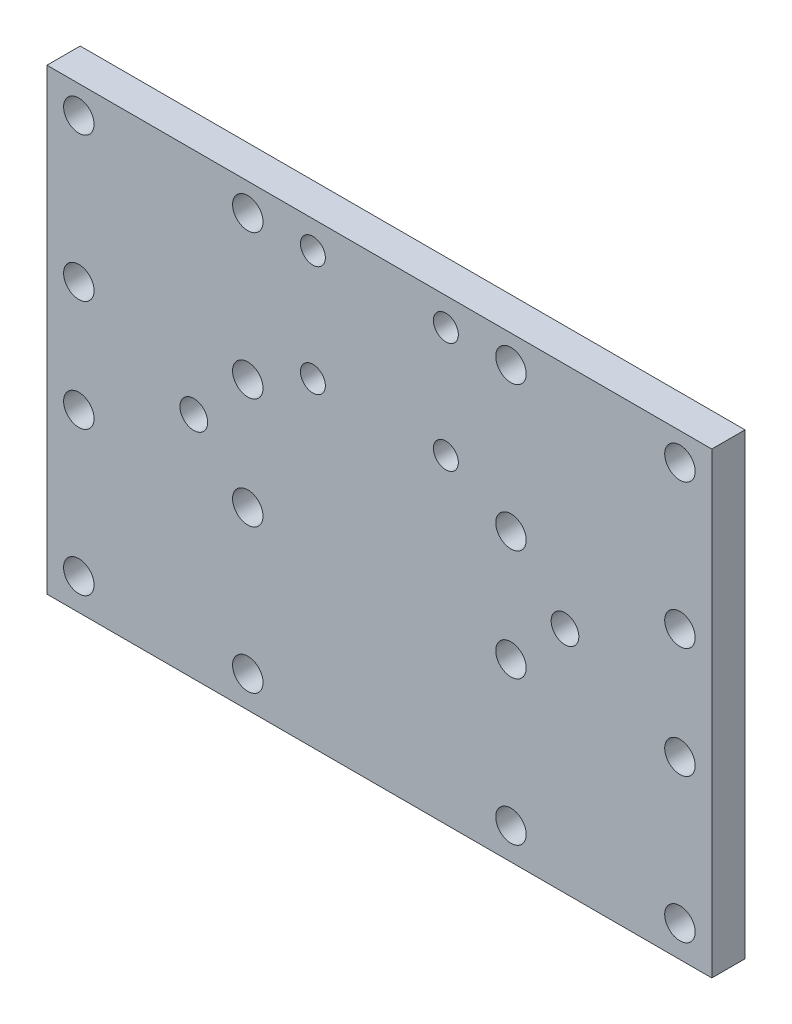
ISO-10303-21;
HEADER;
FILE_DESCRIPTION(('STEP AP214'),'2;1');
FILE_NAME('part.step','',(''),(''),'','','');
FILE_SCHEMA(('AUTOMOTIVE_DESIGN { 1 0 10303 214 1 1 1 1 }'));
ENDSEC;
DATA;
#1=APPLICATION_CONTEXT('core data for automotive mechanical design processes');
#2=APPLICATION_PROTOCOL_DEFINITION('international standard','automotive_design',2000,#1);
#3=PRODUCT_CONTEXT('',#1,'mechanical');
#4=PRODUCT('Part','Part','',(#3));
#5=PRODUCT_RELATED_PRODUCT_CATEGORY('part','',(#4));
#6=PRODUCT_DEFINITION_FORMATION('','',#4);
#7=PRODUCT_DEFINITION_CONTEXT('part definition',#1,'design');
#8=PRODUCT_DEFINITION('design','',#6,#7);
#9=PRODUCT_DEFINITION_SHAPE('','',#8);
#10=(LENGTH_UNIT() NAMED_UNIT(*) SI_UNIT(.MILLI.,.METRE.));
#11=(NAMED_UNIT(*) PLANE_ANGLE_UNIT() SI_UNIT($,.RADIAN.));
#12=(NAMED_UNIT(*) SI_UNIT($,.STERADIAN.) SOLID_ANGLE_UNIT());
#13=UNCERTAINTY_MEASURE_WITH_UNIT(LENGTH_MEASURE(1.E-05),#10,'distance_accuracy_value','');
#14=(GEOMETRIC_REPRESENTATION_CONTEXT(3) GLOBAL_UNCERTAINTY_ASSIGNED_CONTEXT((#13)) GLOBAL_UNIT_ASSIGNED_CONTEXT((#10,
#11,#12)) REPRESENTATION_CONTEXT('',''));
#15=CARTESIAN_POINT('',(0.,0.,0.));
#16=DIRECTION('',(0.,0.,1.));
#17=DIRECTION('',(1.,0.,0.));
#18=AXIS2_PLACEMENT_3D('',#15,#16,#17);
#19=CARTESIAN_POINT('',(0.,0.,6.));
#20=DIRECTION('',(0.,0.,1.));
#21=DIRECTION('',(1.,0.,0.));
#22=AXIS2_PLACEMENT_3D('',#19,#20,#21);
#23=PLANE('',#22);
#24=CARTESIAN_POINT('',(-564.752910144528,240.130205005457,6.));
#25=DIRECTION('',(0.,0.,1.));
#26=DIRECTION('',(1.,0.,0.));
#27=AXIS2_PLACEMENT_3D('',#24,#25,#26);
#28=CIRCLE('',#27,2.49999999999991);
#29=CARTESIAN_POINT('',(-562.252910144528,240.130205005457,6.));
#30=VERTEX_POINT('',#29);
#31=EDGE_CURVE('E245',#30,#30,#28,.T.);
#32=ORIENTED_EDGE('',*,*,#31,.F.);
#33=EDGE_LOOP('',(#32));
#34=FACE_BOUND('',#33,.T.);
#35=CARTESIAN_POINT('',(-631.752910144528,240.130205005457,6.));
#36=DIRECTION('',(0.,0.,1.));
#37=DIRECTION('',(1.,0.,0.));
#38=AXIS2_PLACEMENT_3D('',#35,#36,#37);
#39=CIRCLE('',#38,2.49999999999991);
#40=CARTESIAN_POINT('',(-629.252910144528,240.130205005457,6.));
#41=VERTEX_POINT('',#40);
#42=EDGE_CURVE('E239',#41,#41,#39,.T.);
#43=ORIENTED_EDGE('',*,*,#42,.F.);
#44=EDGE_LOOP('',(#43));
#45=FACE_BOUND('',#44,.T.);
#46=CARTESIAN_POINT('',(-544.002910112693,204.473137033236,6.));
#47=DIRECTION('',(0.,0.,1.));
#48=DIRECTION('',(1.,0.,0.));
#49=AXIS2_PLACEMENT_3D('',#46,#47,#48);
#50=CIRCLE('',#49,2.75000000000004);
#51=CARTESIAN_POINT('',(-541.252910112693,204.473137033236,6.));
#52=VERTEX_POINT('',#51);
#53=EDGE_CURVE('E224',#52,#52,#50,.T.);
#54=ORIENTED_EDGE('',*,*,#53,.F.);
#55=EDGE_LOOP('',(#54));
#56=FACE_BOUND('',#55,.T.);
#57=CARTESIAN_POINT('',(-574.502910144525,230.473137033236,6.));
#58=DIRECTION('',(0.,0.,1.));
#59=DIRECTION('',(1.,0.,0.));
#60=AXIS2_PLACEMENT_3D('',#57,#58,#59);
#61=CIRCLE('',#60,2.75000000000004);
#62=CARTESIAN_POINT('',(-571.752910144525,230.473137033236,6.));
#63=VERTEX_POINT('',#62);
#64=EDGE_CURVE('E212',#63,#63,#61,.T.);
#65=ORIENTED_EDGE('',*,*,#64,.F.);
#66=EDGE_LOOP('',(#65));
#67=FACE_BOUND('',#66,.T.);
#68=CARTESIAN_POINT('',(-652.502910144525,204.473137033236,6.));
#69=DIRECTION('',(0.,0.,1.));
#70=DIRECTION('',(1.,0.,0.));
#71=AXIS2_PLACEMENT_3D('',#68,#69,#70);
#72=CIRCLE('',#71,2.75000000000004);
#73=CARTESIAN_POINT('',(-649.752910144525,204.473137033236,6.));
#74=VERTEX_POINT('',#73);
#75=EDGE_CURVE('E200',#74,#74,#72,.T.);
#76=ORIENTED_EDGE('',*,*,#75,.F.);
#77=EDGE_LOOP('',(#76));
#78=FACE_BOUND('',#77,.T.);
#79=CARTESIAN_POINT('',(-652.502910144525,230.473137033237,6.));
#80=DIRECTION('',(0.,0.,1.));
#81=DIRECTION('',(1.,0.,0.));
#82=AXIS2_PLACEMENT_3D('',#79,#80,#81);
#83=CIRCLE('',#82,2.75000000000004);
#84=CARTESIAN_POINT('',(-649.752910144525,230.473137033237,6.));
#85=VERTEX_POINT('',#84);
#86=EDGE_CURVE('E188',#85,#85,#83,.T.);
#87=ORIENTED_EDGE('',*,*,#86,.F.);
#88=EDGE_LOOP('',(#87));
#89=FACE_BOUND('',#88,.T.);
#90=CARTESIAN_POINT('',(-622.002910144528,250.473137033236,6.));
#91=DIRECTION('',(0.,0.,1.));
#92=DIRECTION('',(1.,0.,0.));
#93=AXIS2_PLACEMENT_3D('',#90,#91,#92);
#94=CIRCLE('',#93,2.75000000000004);
#95=CARTESIAN_POINT('',(-619.252910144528,250.473137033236,6.));
#96=VERTEX_POINT('',#95);
#97=EDGE_CURVE('E176',#96,#96,#94,.T.);
#98=ORIENTED_EDGE('',*,*,#97,.F.);
#99=EDGE_LOOP('',(#98));
#100=FACE_BOUND('',#99,.T.);
#101=CARTESIAN_POINT('',(-586.252910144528,256.473137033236,6.));
#102=DIRECTION('',(0.,0.,1.));
#103=DIRECTION('',(1.,0.,0.));
#104=AXIS2_PLACEMENT_3D('',#101,#102,#103);
#105=CIRCLE('',#104,2.25000000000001);
#106=CARTESIAN_POINT('',(-584.002910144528,256.473137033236,6.));
#107=VERTEX_POINT('',#106);
#108=EDGE_CURVE('E164',#107,#107,#105,.T.);
#109=ORIENTED_EDGE('',*,*,#108,.F.);
#110=EDGE_LOOP('',(#109));
#111=FACE_BOUND('',#110,.T.);
#112=CARTESIAN_POINT('',(-544.002910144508,250.473137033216,6.));
#113=DIRECTION('',(0.,0.,1.));
#114=DIRECTION('',(1.,0.,0.));
#115=AXIS2_PLACEMENT_3D('',#112,#113,#114);
#116=CIRCLE('',#115,2.75000000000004);
#117=CARTESIAN_POINT('',(-541.252910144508,250.473137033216,6.));
#118=VERTEX_POINT('',#117);
#119=EDGE_CURVE('E152',#118,#118,#116,.T.);
#120=ORIENTED_EDGE('',*,*,#119,.F.);
#121=EDGE_LOOP('',(#120));
#122=FACE_BOUND('',#121,.T.);
#123=CARTESIAN_POINT('',(-574.502910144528,276.473137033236,6.));
#124=DIRECTION('',(0.,0.,1.));
#125=DIRECTION('',(1.,0.,0.));
#126=AXIS2_PLACEMENT_3D('',#123,#124,#125);
#127=CIRCLE('',#126,2.75000000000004);
#128=CARTESIAN_POINT('',(-571.752910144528,276.473137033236,6.));
#129=VERTEX_POINT('',#128);
#130=EDGE_CURVE('E140',#129,#129,#127,.T.);
#131=ORIENTED_EDGE('',*,*,#130,.F.);
#132=EDGE_LOOP('',(#131));
#133=FACE_BOUND('',#132,.T.);
#134=CARTESIAN_POINT('',(-610.252910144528,276.473137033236,6.));
#135=DIRECTION('',(0.,0.,1.));
#136=DIRECTION('',(1.,0.,0.));
#137=AXIS2_PLACEMENT_3D('',#134,#135,#136);
#138=CIRCLE('',#137,2.25000000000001);
#139=CARTESIAN_POINT('',(-608.002910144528,276.473137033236,6.));
#140=VERTEX_POINT('',#139);
#141=EDGE_CURVE('E128',#140,#140,#138,.T.);
#142=ORIENTED_EDGE('',*,*,#141,.F.);
#143=EDGE_LOOP('',(#142));
#144=FACE_BOUND('',#143,.T.);
#145=CARTESIAN_POINT('',(-652.502910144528,276.473137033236,6.));
#146=DIRECTION('',(0.,0.,1.));
#147=DIRECTION('',(1.,0.,0.));
#148=AXIS2_PLACEMENT_3D('',#145,#146,#147);
#149=CIRCLE('',#148,2.75000000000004);
#150=CARTESIAN_POINT('',(-649.752910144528,276.473137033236,6.));
#151=VERTEX_POINT('',#150);
#152=EDGE_CURVE('E107',#151,#151,#149,.T.);
#153=ORIENTED_EDGE('',*,*,#152,.F.);
#154=EDGE_LOOP('',(#153));
#155=FACE_BOUND('',#154,.T.);
#156=DIRECTION('',(0.,-1.,0.));
#157=VECTOR('',#156,1.);
#158=CARTESIAN_POINT('',(-658.252910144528,281.473137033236,6.));
#159=LINE('',#158,#157);
#160=CARTESIAN_POINT('',(-658.252910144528,281.473137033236,6.));
#161=VERTEX_POINT('',#160);
#162=CARTESIAN_POINT('',(-658.252910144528,198.787272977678,6.));
#163=VERTEX_POINT('',#162);
#164=EDGE_CURVE('E92',#161,#163,#159,.T.);
#165=ORIENTED_EDGE('',*,*,#164,.T.);
#166=DIRECTION('',(1.,0.,0.));
#167=VECTOR('',#166,1.);
#168=CARTESIAN_POINT('',(-658.252910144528,198.787272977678,6.));
#169=LINE('',#168,#167);
#170=CARTESIAN_POINT('',(-538.252910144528,198.787272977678,6.));
#171=VERTEX_POINT('',#170);
#172=EDGE_CURVE('E87',#163,#171,#169,.T.);
#173=ORIENTED_EDGE('',*,*,#172,.T.);
#174=DIRECTION('',(0.,1.,0.));
#175=VECTOR('',#174,1.);
#176=CARTESIAN_POINT('',(-538.252910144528,281.473137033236,6.));
#177=LINE('',#176,#175);
#178=CARTESIAN_POINT('',(-538.252910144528,281.473137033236,6.));
#179=VERTEX_POINT('',#178);
#180=EDGE_CURVE('E90',#171,#179,#177,.T.);
#181=ORIENTED_EDGE('',*,*,#180,.T.);
#182=DIRECTION('',(-1.,0.,0.));
#183=VECTOR('',#182,1.);
#184=CARTESIAN_POINT('',(-658.252910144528,281.473137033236,6.));
#185=LINE('',#184,#183);
#186=EDGE_CURVE('E57',#179,#161,#185,.T.);
#187=ORIENTED_EDGE('',*,*,#186,.T.);
#188=EDGE_LOOP('',(#165,#173,#181,#187));
#189=FACE_BOUND('',#188,.T.);
#190=CARTESIAN_POINT('',(-622.002910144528,276.473137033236,6.));
#191=DIRECTION('',(0.,0.,1.));
#192=DIRECTION('',(1.,0.,0.));
#193=AXIS2_PLACEMENT_3D('',#190,#191,#192);
#194=CIRCLE('',#193,2.75000000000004);
#195=CARTESIAN_POINT('',(-619.252910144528,276.473137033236,6.));
#196=VERTEX_POINT('',#195);
#197=EDGE_CURVE('E122',#196,#196,#194,.T.);
#198=ORIENTED_EDGE('',*,*,#197,.F.);
#199=EDGE_LOOP('',(#198));
#200=FACE_BOUND('',#199,.T.);
#201=CARTESIAN_POINT('',(-586.252910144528,276.473137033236,6.));
#202=DIRECTION('',(0.,0.,1.));
#203=DIRECTION('',(1.,0.,0.));
#204=AXIS2_PLACEMENT_3D('',#201,#202,#203);
#205=CIRCLE('',#204,2.25000000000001);
#206=CARTESIAN_POINT('',(-584.002910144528,276.473137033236,6.));
#207=VERTEX_POINT('',#206);
#208=EDGE_CURVE('E134',#207,#207,#205,.T.);
#209=ORIENTED_EDGE('',*,*,#208,.F.);
#210=EDGE_LOOP('',(#209));
#211=FACE_BOUND('',#210,.T.);
#212=CARTESIAN_POINT('',(-544.002910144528,276.473137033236,6.));
#213=DIRECTION('',(0.,0.,1.));
#214=DIRECTION('',(1.,0.,0.));
#215=AXIS2_PLACEMENT_3D('',#212,#213,#214);
#216=CIRCLE('',#215,2.75000000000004);
#217=CARTESIAN_POINT('',(-541.252910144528,276.473137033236,6.));
#218=VERTEX_POINT('',#217);
#219=EDGE_CURVE('E146',#218,#218,#216,.T.);
#220=ORIENTED_EDGE('',*,*,#219,.F.);
#221=EDGE_LOOP('',(#220));
#222=FACE_BOUND('',#221,.T.);
#223=CARTESIAN_POINT('',(-574.502910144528,250.473137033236,6.));
#224=DIRECTION('',(0.,0.,1.));
#225=DIRECTION('',(1.,0.,0.));
#226=AXIS2_PLACEMENT_3D('',#223,#224,#225);
#227=CIRCLE('',#226,2.75000000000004);
#228=CARTESIAN_POINT('',(-571.752910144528,250.473137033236,6.));
#229=VERTEX_POINT('',#228);
#230=EDGE_CURVE('E158',#229,#229,#227,.T.);
#231=ORIENTED_EDGE('',*,*,#230,.F.);
#232=EDGE_LOOP('',(#231));
#233=FACE_BOUND('',#232,.T.);
#234=CARTESIAN_POINT('',(-610.252910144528,256.473137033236,6.));
#235=DIRECTION('',(0.,0.,1.));
#236=DIRECTION('',(1.,0.,0.));
#237=AXIS2_PLACEMENT_3D('',#234,#235,#236);
#238=CIRCLE('',#237,2.25000000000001);
#239=CARTESIAN_POINT('',(-608.002910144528,256.473137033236,6.));
#240=VERTEX_POINT('',#239);
#241=EDGE_CURVE('E170',#240,#240,#238,.T.);
#242=ORIENTED_EDGE('',*,*,#241,.F.);
#243=EDGE_LOOP('',(#242));
#244=FACE_BOUND('',#243,.T.);
#245=CARTESIAN_POINT('',(-652.502910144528,250.473137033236,6.));
#246=DIRECTION('',(0.,0.,1.));
#247=DIRECTION('',(1.,0.,0.));
#248=AXIS2_PLACEMENT_3D('',#245,#246,#247);
#249=CIRCLE('',#248,2.75000000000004);
#250=CARTESIAN_POINT('',(-649.752910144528,250.473137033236,6.));
#251=VERTEX_POINT('',#250);
#252=EDGE_CURVE('E182',#251,#251,#249,.T.);
#253=ORIENTED_EDGE('',*,*,#252,.F.);
#254=EDGE_LOOP('',(#253));
#255=FACE_BOUND('',#254,.T.);
#256=CARTESIAN_POINT('',(-622.002910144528,230.473137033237,6.));
#257=DIRECTION('',(0.,0.,1.));
#258=DIRECTION('',(1.,0.,0.));
#259=AXIS2_PLACEMENT_3D('',#256,#257,#258);
#260=CIRCLE('',#259,2.75000000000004);
#261=CARTESIAN_POINT('',(-619.252910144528,230.473137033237,6.));
#262=VERTEX_POINT('',#261);
#263=EDGE_CURVE('E194',#262,#262,#260,.T.);
#264=ORIENTED_EDGE('',*,*,#263,.F.);
#265=EDGE_LOOP('',(#264));
#266=FACE_BOUND('',#265,.T.);
#267=CARTESIAN_POINT('',(-622.002910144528,204.473137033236,6.));
#268=DIRECTION('',(0.,0.,1.));
#269=DIRECTION('',(1.,0.,0.));
#270=AXIS2_PLACEMENT_3D('',#267,#268,#269);
#271=CIRCLE('',#270,2.75000000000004);
#272=CARTESIAN_POINT('',(-619.252910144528,204.473137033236,6.));
#273=VERTEX_POINT('',#272);
#274=EDGE_CURVE('E206',#273,#273,#271,.T.);
#275=ORIENTED_EDGE('',*,*,#274,.F.);
#276=EDGE_LOOP('',(#275));
#277=FACE_BOUND('',#276,.T.);
#278=CARTESIAN_POINT('',(-574.502910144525,204.473137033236,6.));
#279=DIRECTION('',(0.,0.,1.));
#280=DIRECTION('',(1.,0.,0.));
#281=AXIS2_PLACEMENT_3D('',#278,#279,#280);
#282=CIRCLE('',#281,2.75000000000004);
#283=CARTESIAN_POINT('',(-571.752910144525,204.473137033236,6.));
#284=VERTEX_POINT('',#283);
#285=EDGE_CURVE('E218',#284,#284,#282,.T.);
#286=ORIENTED_EDGE('',*,*,#285,.F.);
#287=EDGE_LOOP('',(#286));
#288=FACE_BOUND('',#287,.T.);
#289=CARTESIAN_POINT('',(-544.002910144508,230.473137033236,6.));
#290=DIRECTION('',(0.,0.,1.));
#291=DIRECTION('',(1.,0.,0.));
#292=AXIS2_PLACEMENT_3D('',#289,#290,#291);
#293=CIRCLE('',#292,2.75000000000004);
#294=CARTESIAN_POINT('',(-541.252910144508,230.473137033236,6.));
#295=VERTEX_POINT('',#294);
#296=EDGE_CURVE('E230',#295,#295,#293,.T.);
#297=ORIENTED_EDGE('',*,*,#296,.F.);
#298=EDGE_LOOP('',(#297));
#299=FACE_BOUND('',#298,.T.);
#300=ADVANCED_FACE('F40',(#34,#45,#56,#67,#78,#89,#100,#111,#122,#133,#144,#155,#189,#200,#211,
#222,#233,#244,#255,#266,#277,#288,#299),#23,.T.);
#301=CARTESIAN_POINT('',(0.,0.,0.));
#302=DIRECTION('',(0.,0.,1.));
#303=DIRECTION('',(1.,0.,0.));
#304=AXIS2_PLACEMENT_3D('',#301,#302,#303);
#305=PLANE('',#304);
#306=CARTESIAN_POINT('',(-564.752910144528,240.130205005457,0.));
#307=DIRECTION('',(0.,0.,1.));
#308=DIRECTION('',(1.,0.,0.));
#309=AXIS2_PLACEMENT_3D('',#306,#307,#308);
#310=CIRCLE('',#309,2.49999999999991);
#311=CARTESIAN_POINT('',(-562.252910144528,240.130205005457,0.));
#312=VERTEX_POINT('',#311);
#313=EDGE_CURVE('E242',#312,#312,#310,.T.);
#314=ORIENTED_EDGE('',*,*,#313,.T.);
#315=EDGE_LOOP('',(#314));
#316=FACE_BOUND('',#315,.T.);
#317=CARTESIAN_POINT('',(-631.752910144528,240.130205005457,0.));
#318=DIRECTION('',(0.,0.,1.));
#319=DIRECTION('',(1.,0.,0.));
#320=AXIS2_PLACEMENT_3D('',#317,#318,#319);
#321=CIRCLE('',#320,2.49999999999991);
#322=CARTESIAN_POINT('',(-629.252910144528,240.130205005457,0.));
#323=VERTEX_POINT('',#322);
#324=EDGE_CURVE('E236',#323,#323,#321,.T.);
#325=ORIENTED_EDGE('',*,*,#324,.T.);
#326=EDGE_LOOP('',(#325));
#327=FACE_BOUND('',#326,.T.);
#328=DIRECTION('',(0.,-1.,0.));
#329=VECTOR('',#328,1.);
#330=CARTESIAN_POINT('',(-658.252910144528,281.473137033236,0.));
#331=LINE('',#330,#329);
#332=CARTESIAN_POINT('',(-658.252910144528,281.473137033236,0.));
#333=VERTEX_POINT('',#332);
#334=CARTESIAN_POINT('',(-658.252910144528,198.787272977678,0.));
#335=VERTEX_POINT('',#334);
#336=EDGE_CURVE('E104',#333,#335,#331,.T.);
#337=ORIENTED_EDGE('',*,*,#336,.F.);
#338=DIRECTION('',(-1.,0.,0.));
#339=VECTOR('',#338,1.);
#340=CARTESIAN_POINT('',(-658.252910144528,281.473137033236,0.));
#341=LINE('',#340,#339);
#342=CARTESIAN_POINT('',(-538.252910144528,281.473137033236,0.));
#343=VERTEX_POINT('',#342);
#344=EDGE_CURVE('E80',#343,#333,#341,.T.);
#345=ORIENTED_EDGE('',*,*,#344,.F.);
#346=DIRECTION('',(0.,1.,0.));
#347=VECTOR('',#346,1.);
#348=CARTESIAN_POINT('',(-538.252910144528,281.473137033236,0.));
#349=LINE('',#348,#347);
#350=CARTESIAN_POINT('',(-538.252910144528,198.787272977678,0.));
#351=VERTEX_POINT('',#350);
#352=EDGE_CURVE('E74',#351,#343,#349,.T.);
#353=ORIENTED_EDGE('',*,*,#352,.F.);
#354=DIRECTION('',(1.,0.,0.));
#355=VECTOR('',#354,1.);
#356=CARTESIAN_POINT('',(-658.252910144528,198.787272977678,0.));
#357=LINE('',#356,#355);
#358=EDGE_CURVE('E96',#335,#351,#357,.T.);
#359=ORIENTED_EDGE('',*,*,#358,.F.);
#360=EDGE_LOOP('',(#337,#345,#353,#359));
#361=FACE_BOUND('',#360,.T.);
#362=CARTESIAN_POINT('',(-652.502910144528,276.473137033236,0.));
#363=DIRECTION('',(0.,0.,1.));
#364=DIRECTION('',(1.,0.,0.));
#365=AXIS2_PLACEMENT_3D('',#362,#363,#364);
#366=CIRCLE('',#365,2.75000000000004);
#367=CARTESIAN_POINT('',(-649.752910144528,276.473137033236,0.));
#368=VERTEX_POINT('',#367);
#369=EDGE_CURVE('E119',#368,#368,#366,.T.);
#370=ORIENTED_EDGE('',*,*,#369,.T.);
#371=EDGE_LOOP('',(#370));
#372=FACE_BOUND('',#371,.T.);
#373=CARTESIAN_POINT('',(-622.002910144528,276.473137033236,0.));
#374=DIRECTION('',(0.,0.,1.));
#375=DIRECTION('',(1.,0.,0.));
#376=AXIS2_PLACEMENT_3D('',#373,#374,#375);
#377=CIRCLE('',#376,2.75000000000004);
#378=CARTESIAN_POINT('',(-619.252910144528,276.473137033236,0.));
#379=VERTEX_POINT('',#378);
#380=EDGE_CURVE('E125',#379,#379,#377,.T.);
#381=ORIENTED_EDGE('',*,*,#380,.T.);
#382=EDGE_LOOP('',(#381));
#383=FACE_BOUND('',#382,.T.);
#384=CARTESIAN_POINT('',(-610.252910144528,276.473137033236,0.));
#385=DIRECTION('',(0.,0.,1.));
#386=DIRECTION('',(1.,0.,0.));
#387=AXIS2_PLACEMENT_3D('',#384,#385,#386);
#388=CIRCLE('',#387,2.25000000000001);
#389=CARTESIAN_POINT('',(-608.002910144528,276.473137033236,0.));
#390=VERTEX_POINT('',#389);
#391=EDGE_CURVE('E131',#390,#390,#388,.T.);
#392=ORIENTED_EDGE('',*,*,#391,.T.);
#393=EDGE_LOOP('',(#392));
#394=FACE_BOUND('',#393,.T.);
#395=CARTESIAN_POINT('',(-586.252910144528,276.473137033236,0.));
#396=DIRECTION('',(0.,0.,1.));
#397=DIRECTION('',(1.,0.,0.));
#398=AXIS2_PLACEMENT_3D('',#395,#396,#397);
#399=CIRCLE('',#398,2.25000000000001);
#400=CARTESIAN_POINT('',(-584.002910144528,276.473137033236,0.));
#401=VERTEX_POINT('',#400);
#402=EDGE_CURVE('E137',#401,#401,#399,.T.);
#403=ORIENTED_EDGE('',*,*,#402,.T.);
#404=EDGE_LOOP('',(#403));
#405=FACE_BOUND('',#404,.T.);
#406=CARTESIAN_POINT('',(-574.502910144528,276.473137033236,0.));
#407=DIRECTION('',(0.,0.,1.));
#408=DIRECTION('',(1.,0.,0.));
#409=AXIS2_PLACEMENT_3D('',#406,#407,#408);
#410=CIRCLE('',#409,2.75000000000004);
#411=CARTESIAN_POINT('',(-571.752910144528,276.473137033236,0.));
#412=VERTEX_POINT('',#411);
#413=EDGE_CURVE('E143',#412,#412,#410,.T.);
#414=ORIENTED_EDGE('',*,*,#413,.T.);
#415=EDGE_LOOP('',(#414));
#416=FACE_BOUND('',#415,.T.);
#417=CARTESIAN_POINT('',(-544.002910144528,276.473137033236,0.));
#418=DIRECTION('',(0.,0.,1.));
#419=DIRECTION('',(1.,0.,0.));
#420=AXIS2_PLACEMENT_3D('',#417,#418,#419);
#421=CIRCLE('',#420,2.75000000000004);
#422=CARTESIAN_POINT('',(-541.252910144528,276.473137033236,0.));
#423=VERTEX_POINT('',#422);
#424=EDGE_CURVE('E149',#423,#423,#421,.T.);
#425=ORIENTED_EDGE('',*,*,#424,.T.);
#426=EDGE_LOOP('',(#425));
#427=FACE_BOUND('',#426,.T.);
#428=CARTESIAN_POINT('',(-544.002910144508,250.473137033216,0.));
#429=DIRECTION('',(0.,0.,1.));
#430=DIRECTION('',(1.,0.,0.));
#431=AXIS2_PLACEMENT_3D('',#428,#429,#430);
#432=CIRCLE('',#431,2.75000000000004);
#433=CARTESIAN_POINT('',(-541.252910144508,250.473137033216,0.));
#434=VERTEX_POINT('',#433);
#435=EDGE_CURVE('E155',#434,#434,#432,.T.);
#436=ORIENTED_EDGE('',*,*,#435,.T.);
#437=EDGE_LOOP('',(#436));
#438=FACE_BOUND('',#437,.T.);
#439=CARTESIAN_POINT('',(-574.502910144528,250.473137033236,0.));
#440=DIRECTION('',(0.,0.,1.));
#441=DIRECTION('',(1.,0.,0.));
#442=AXIS2_PLACEMENT_3D('',#439,#440,#441);
#443=CIRCLE('',#442,2.75000000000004);
#444=CARTESIAN_POINT('',(-571.752910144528,250.473137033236,0.));
#445=VERTEX_POINT('',#444);
#446=EDGE_CURVE('E161',#445,#445,#443,.T.);
#447=ORIENTED_EDGE('',*,*,#446,.T.);
#448=EDGE_LOOP('',(#447));
#449=FACE_BOUND('',#448,.T.);
#450=CARTESIAN_POINT('',(-586.252910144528,256.473137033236,0.));
#451=DIRECTION('',(0.,0.,1.));
#452=DIRECTION('',(1.,0.,0.));
#453=AXIS2_PLACEMENT_3D('',#450,#451,#452);
#454=CIRCLE('',#453,2.25000000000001);
#455=CARTESIAN_POINT('',(-584.002910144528,256.473137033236,0.));
#456=VERTEX_POINT('',#455);
#457=EDGE_CURVE('E167',#456,#456,#454,.T.);
#458=ORIENTED_EDGE('',*,*,#457,.T.);
#459=EDGE_LOOP('',(#458));
#460=FACE_BOUND('',#459,.T.);
#461=CARTESIAN_POINT('',(-610.252910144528,256.473137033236,0.));
#462=DIRECTION('',(0.,0.,1.));
#463=DIRECTION('',(1.,0.,0.));
#464=AXIS2_PLACEMENT_3D('',#461,#462,#463);
#465=CIRCLE('',#464,2.25000000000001);
#466=CARTESIAN_POINT('',(-608.002910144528,256.473137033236,0.));
#467=VERTEX_POINT('',#466);
#468=EDGE_CURVE('E173',#467,#467,#465,.T.);
#469=ORIENTED_EDGE('',*,*,#468,.T.);
#470=EDGE_LOOP('',(#469));
#471=FACE_BOUND('',#470,.T.);
#472=CARTESIAN_POINT('',(-622.002910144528,250.473137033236,0.));
#473=DIRECTION('',(0.,0.,1.));
#474=DIRECTION('',(1.,0.,0.));
#475=AXIS2_PLACEMENT_3D('',#472,#473,#474);
#476=CIRCLE('',#475,2.75000000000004);
#477=CARTESIAN_POINT('',(-619.252910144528,250.473137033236,0.));
#478=VERTEX_POINT('',#477);
#479=EDGE_CURVE('E179',#478,#478,#476,.T.);
#480=ORIENTED_EDGE('',*,*,#479,.T.);
#481=EDGE_LOOP('',(#480));
#482=FACE_BOUND('',#481,.T.);
#483=CARTESIAN_POINT('',(-652.502910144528,250.473137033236,0.));
#484=DIRECTION('',(0.,0.,1.));
#485=DIRECTION('',(1.,0.,0.));
#486=AXIS2_PLACEMENT_3D('',#483,#484,#485);
#487=CIRCLE('',#486,2.75000000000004);
#488=CARTESIAN_POINT('',(-649.752910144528,250.473137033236,0.));
#489=VERTEX_POINT('',#488);
#490=EDGE_CURVE('E185',#489,#489,#487,.T.);
#491=ORIENTED_EDGE('',*,*,#490,.T.);
#492=EDGE_LOOP('',(#491));
#493=FACE_BOUND('',#492,.T.);
#494=CARTESIAN_POINT('',(-652.502910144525,230.473137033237,0.));
#495=DIRECTION('',(0.,0.,1.));
#496=DIRECTION('',(1.,0.,0.));
#497=AXIS2_PLACEMENT_3D('',#494,#495,#496);
#498=CIRCLE('',#497,2.75000000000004);
#499=CARTESIAN_POINT('',(-649.752910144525,230.473137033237,0.));
#500=VERTEX_POINT('',#499);
#501=EDGE_CURVE('E191',#500,#500,#498,.T.);
#502=ORIENTED_EDGE('',*,*,#501,.T.);
#503=EDGE_LOOP('',(#502));
#504=FACE_BOUND('',#503,.T.);
#505=CARTESIAN_POINT('',(-622.002910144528,230.473137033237,0.));
#506=DIRECTION('',(0.,0.,1.));
#507=DIRECTION('',(1.,0.,0.));
#508=AXIS2_PLACEMENT_3D('',#505,#506,#507);
#509=CIRCLE('',#508,2.75000000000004);
#510=CARTESIAN_POINT('',(-619.252910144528,230.473137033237,0.));
#511=VERTEX_POINT('',#510);
#512=EDGE_CURVE('E197',#511,#511,#509,.T.);
#513=ORIENTED_EDGE('',*,*,#512,.T.);
#514=EDGE_LOOP('',(#513));
#515=FACE_BOUND('',#514,.T.);
#516=CARTESIAN_POINT('',(-652.502910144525,204.473137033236,0.));
#517=DIRECTION('',(0.,0.,1.));
#518=DIRECTION('',(1.,0.,0.));
#519=AXIS2_PLACEMENT_3D('',#516,#517,#518);
#520=CIRCLE('',#519,2.75000000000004);
#521=CARTESIAN_POINT('',(-649.752910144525,204.473137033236,0.));
#522=VERTEX_POINT('',#521);
#523=EDGE_CURVE('E203',#522,#522,#520,.T.);
#524=ORIENTED_EDGE('',*,*,#523,.T.);
#525=EDGE_LOOP('',(#524));
#526=FACE_BOUND('',#525,.T.);
#527=CARTESIAN_POINT('',(-622.002910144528,204.473137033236,0.));
#528=DIRECTION('',(0.,0.,1.));
#529=DIRECTION('',(1.,0.,0.));
#530=AXIS2_PLACEMENT_3D('',#527,#528,#529);
#531=CIRCLE('',#530,2.75000000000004);
#532=CARTESIAN_POINT('',(-619.252910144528,204.473137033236,0.));
#533=VERTEX_POINT('',#532);
#534=EDGE_CURVE('E209',#533,#533,#531,.T.);
#535=ORIENTED_EDGE('',*,*,#534,.T.);
#536=EDGE_LOOP('',(#535));
#537=FACE_BOUND('',#536,.T.);
#538=CARTESIAN_POINT('',(-574.502910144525,230.473137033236,0.));
#539=DIRECTION('',(0.,0.,1.));
#540=DIRECTION('',(1.,0.,0.));
#541=AXIS2_PLACEMENT_3D('',#538,#539,#540);
#542=CIRCLE('',#541,2.75000000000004);
#543=CARTESIAN_POINT('',(-571.752910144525,230.473137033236,0.));
#544=VERTEX_POINT('',#543);
#545=EDGE_CURVE('E215',#544,#544,#542,.T.);
#546=ORIENTED_EDGE('',*,*,#545,.T.);
#547=EDGE_LOOP('',(#546));
#548=FACE_BOUND('',#547,.T.);
#549=CARTESIAN_POINT('',(-574.502910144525,204.473137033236,0.));
#550=DIRECTION('',(0.,0.,1.));
#551=DIRECTION('',(1.,0.,0.));
#552=AXIS2_PLACEMENT_3D('',#549,#550,#551);
#553=CIRCLE('',#552,2.75000000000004);
#554=CARTESIAN_POINT('',(-571.752910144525,204.473137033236,0.));
#555=VERTEX_POINT('',#554);
#556=EDGE_CURVE('E221',#555,#555,#553,.T.);
#557=ORIENTED_EDGE('',*,*,#556,.T.);
#558=EDGE_LOOP('',(#557));
#559=FACE_BOUND('',#558,.T.);
#560=CARTESIAN_POINT('',(-544.002910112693,204.473137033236,0.));
#561=DIRECTION('',(0.,0.,1.));
#562=DIRECTION('',(1.,0.,0.));
#563=AXIS2_PLACEMENT_3D('',#560,#561,#562);
#564=CIRCLE('',#563,2.75000000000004);
#565=CARTESIAN_POINT('',(-541.252910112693,204.473137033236,0.));
#566=VERTEX_POINT('',#565);
#567=EDGE_CURVE('E227',#566,#566,#564,.T.);
#568=ORIENTED_EDGE('',*,*,#567,.T.);
#569=EDGE_LOOP('',(#568));
#570=FACE_BOUND('',#569,.T.);
#571=CARTESIAN_POINT('',(-544.002910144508,230.473137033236,0.));
#572=DIRECTION('',(0.,0.,1.));
#573=DIRECTION('',(1.,0.,0.));
#574=AXIS2_PLACEMENT_3D('',#571,#572,#573);
#575=CIRCLE('',#574,2.75000000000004);
#576=CARTESIAN_POINT('',(-541.252910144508,230.473137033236,0.));
#577=VERTEX_POINT('',#576);
#578=EDGE_CURVE('E233',#577,#577,#575,.T.);
#579=ORIENTED_EDGE('',*,*,#578,.T.);
#580=EDGE_LOOP('',(#579));
#581=FACE_BOUND('',#580,.T.);
#582=ADVANCED_FACE('F115',(#316,#327,#361,#372,#383,#394,#405,#416,#427,#438,#449,#460,#471,
#482,#493,#504,#515,#526,#537,#548,#559,#570,#581),#305,.F.);
#583=CARTESIAN_POINT('',(-658.252910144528,281.473137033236,6.));
#584=DIRECTION('',(1.,0.,0.));
#585=DIRECTION('',(0.,0.,-1.));
#586=AXIS2_PLACEMENT_3D('',#583,#584,#585);
#587=PLANE('',#586);
#588=ORIENTED_EDGE('',*,*,#336,.T.);
#589=DIRECTION('',(0.,0.,-1.));
#590=VECTOR('',#589,1.);
#591=CARTESIAN_POINT('',(-658.252910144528,198.787272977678,6.));
#592=LINE('',#591,#590);
#593=EDGE_CURVE('E11',#163,#335,#592,.T.);
#594=ORIENTED_EDGE('',*,*,#593,.F.);
#595=ORIENTED_EDGE('',*,*,#164,.F.);
#596=DIRECTION('',(0.,0.,-1.));
#597=VECTOR('',#596,1.);
#598=CARTESIAN_POINT('',(-658.252910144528,281.473137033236,6.));
#599=LINE('',#598,#597);
#600=EDGE_CURVE('E100',#161,#333,#599,.T.);
#601=ORIENTED_EDGE('',*,*,#600,.T.);
#602=EDGE_LOOP('',(#588,#594,#595,#601));
#603=FACE_BOUND('',#602,.T.);
#604=ADVANCED_FACE('F42',(#603),#587,.F.);
#605=CARTESIAN_POINT('',(-658.252910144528,198.787272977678,6.));
#606=DIRECTION('',(0.,1.,0.));
#607=DIRECTION('',(0.,0.,1.));
#608=AXIS2_PLACEMENT_3D('',#605,#606,#607);
#609=PLANE('',#608);
#610=ORIENTED_EDGE('',*,*,#358,.T.);
#611=DIRECTION('',(0.,0.,-1.));
#612=VECTOR('',#611,1.);
#613=CARTESIAN_POINT('',(-538.252910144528,198.787272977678,6.));
#614=LINE('',#613,#612);
#615=EDGE_CURVE('E49',#171,#351,#614,.T.);
#616=ORIENTED_EDGE('',*,*,#615,.F.);
#617=ORIENTED_EDGE('',*,*,#172,.F.);
#618=ORIENTED_EDGE('',*,*,#593,.T.);
#619=EDGE_LOOP('',(#610,#616,#617,#618));
#620=FACE_BOUND('',#619,.T.);
#621=ADVANCED_FACE('F95',(#620),#609,.F.);
#622=CARTESIAN_POINT('',(-538.252910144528,281.473137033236,6.));
#623=DIRECTION('',(-1.,0.,0.));
#624=DIRECTION('',(0.,0.,1.));
#625=AXIS2_PLACEMENT_3D('',#622,#623,#624);
#626=PLANE('',#625);
#627=ORIENTED_EDGE('',*,*,#352,.T.);
#628=DIRECTION('',(0.,0.,-1.));
#629=VECTOR('',#628,1.);
#630=CARTESIAN_POINT('',(-538.252910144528,281.473137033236,6.));
#631=LINE('',#630,#629);
#632=EDGE_CURVE('E97',#179,#343,#631,.T.);
#633=ORIENTED_EDGE('',*,*,#632,.F.);
#634=ORIENTED_EDGE('',*,*,#180,.F.);
#635=ORIENTED_EDGE('',*,*,#615,.T.);
#636=EDGE_LOOP('',(#627,#633,#634,#635));
#637=FACE_BOUND('',#636,.T.);
#638=ADVANCED_FACE('F98',(#637),#626,.F.);
#639=CARTESIAN_POINT('',(-658.252910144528,281.473137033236,6.));
#640=DIRECTION('',(0.,-1.,0.));
#641=DIRECTION('',(0.,0.,-1.));
#642=AXIS2_PLACEMENT_3D('',#639,#640,#641);
#643=PLANE('',#642);
#644=ORIENTED_EDGE('',*,*,#344,.T.);
#645=ORIENTED_EDGE('',*,*,#600,.F.);
#646=ORIENTED_EDGE('',*,*,#186,.F.);
#647=ORIENTED_EDGE('',*,*,#632,.T.);
#648=EDGE_LOOP('',(#644,#645,#646,#647));
#649=FACE_BOUND('',#648,.T.);
#650=ADVANCED_FACE('F112',(#649),#643,.F.);
#651=CARTESIAN_POINT('',(-652.502910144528,276.473137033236,6.));
#652=DIRECTION('',(0.,0.,-1.));
#653=DIRECTION('',(-1.,0.,0.));
#654=AXIS2_PLACEMENT_3D('',#651,#652,#653);
#655=CYLINDRICAL_SURFACE('',#654,2.75000000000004);
#656=ORIENTED_EDGE('',*,*,#152,.T.);
#657=EDGE_LOOP('',(#656));
#658=FACE_BOUND('',#657,.T.);
#659=ORIENTED_EDGE('',*,*,#369,.F.);
#660=EDGE_LOOP('',(#659));
#661=FACE_BOUND('',#660,.T.);
#662=ADVANCED_FACE('F285',(#658,#661),#655,.F.);
#663=CARTESIAN_POINT('',(-622.002910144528,276.473137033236,6.));
#664=DIRECTION('',(0.,0.,-1.));
#665=DIRECTION('',(-1.,0.,0.));
#666=AXIS2_PLACEMENT_3D('',#663,#664,#665);
#667=CYLINDRICAL_SURFACE('',#666,2.75000000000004);
#668=ORIENTED_EDGE('',*,*,#197,.T.);
#669=EDGE_LOOP('',(#668));
#670=FACE_BOUND('',#669,.T.);
#671=ORIENTED_EDGE('',*,*,#380,.F.);
#672=EDGE_LOOP('',(#671));
#673=FACE_BOUND('',#672,.T.);
#674=ADVANCED_FACE('F288',(#670,#673),#667,.F.);
#675=CARTESIAN_POINT('',(-610.252910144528,276.473137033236,6.));
#676=DIRECTION('',(0.,0.,-1.));
#677=DIRECTION('',(-1.,0.,0.));
#678=AXIS2_PLACEMENT_3D('',#675,#676,#677);
#679=CYLINDRICAL_SURFACE('',#678,2.25000000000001);
#680=ORIENTED_EDGE('',*,*,#141,.T.);
#681=EDGE_LOOP('',(#680));
#682=FACE_BOUND('',#681,.T.);
#683=ORIENTED_EDGE('',*,*,#391,.F.);
#684=EDGE_LOOP('',(#683));
#685=FACE_BOUND('',#684,.T.);
#686=ADVANCED_FACE('F405',(#682,#685),#679,.F.);
#687=CARTESIAN_POINT('',(-586.252910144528,276.473137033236,6.));
#688=DIRECTION('',(0.,0.,-1.));
#689=DIRECTION('',(-1.,0.,0.));
#690=AXIS2_PLACEMENT_3D('',#687,#688,#689);
#691=CYLINDRICAL_SURFACE('',#690,2.25000000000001);
#692=ORIENTED_EDGE('',*,*,#208,.T.);
#693=EDGE_LOOP('',(#692));
#694=FACE_BOUND('',#693,.T.);
#695=ORIENTED_EDGE('',*,*,#402,.F.);
#696=EDGE_LOOP('',(#695));
#697=FACE_BOUND('',#696,.T.);
#698=ADVANCED_FACE('F401',(#694,#697),#691,.F.);
#699=CARTESIAN_POINT('',(-574.502910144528,276.473137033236,6.));
#700=DIRECTION('',(0.,0.,-1.));
#701=DIRECTION('',(-1.,0.,0.));
#702=AXIS2_PLACEMENT_3D('',#699,#700,#701);
#703=CYLINDRICAL_SURFACE('',#702,2.75000000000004);
#704=ORIENTED_EDGE('',*,*,#130,.T.);
#705=EDGE_LOOP('',(#704));
#706=FACE_BOUND('',#705,.T.);
#707=ORIENTED_EDGE('',*,*,#413,.F.);
#708=EDGE_LOOP('',(#707));
#709=FACE_BOUND('',#708,.T.);
#710=ADVANCED_FACE('F397',(#706,#709),#703,.F.);
#711=CARTESIAN_POINT('',(-544.002910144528,276.473137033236,6.));
#712=DIRECTION('',(0.,0.,-1.));
#713=DIRECTION('',(-1.,0.,0.));
#714=AXIS2_PLACEMENT_3D('',#711,#712,#713);
#715=CYLINDRICAL_SURFACE('',#714,2.75000000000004);
#716=ORIENTED_EDGE('',*,*,#219,.T.);
#717=EDGE_LOOP('',(#716));
#718=FACE_BOUND('',#717,.T.);
#719=ORIENTED_EDGE('',*,*,#424,.F.);
#720=EDGE_LOOP('',(#719));
#721=FACE_BOUND('',#720,.T.);
#722=ADVANCED_FACE('F393',(#718,#721),#715,.F.);
#723=CARTESIAN_POINT('',(-544.002910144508,250.473137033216,6.));
#724=DIRECTION('',(0.,0.,-1.));
#725=DIRECTION('',(-1.,0.,0.));
#726=AXIS2_PLACEMENT_3D('',#723,#724,#725);
#727=CYLINDRICAL_SURFACE('',#726,2.75000000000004);
#728=ORIENTED_EDGE('',*,*,#119,.T.);
#729=EDGE_LOOP('',(#728));
#730=FACE_BOUND('',#729,.T.);
#731=ORIENTED_EDGE('',*,*,#435,.F.);
#732=EDGE_LOOP('',(#731));
#733=FACE_BOUND('',#732,.T.);
#734=ADVANCED_FACE('F389',(#730,#733),#727,.F.);
#735=CARTESIAN_POINT('',(-574.502910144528,250.473137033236,6.));
#736=DIRECTION('',(0.,0.,-1.));
#737=DIRECTION('',(-1.,0.,0.));
#738=AXIS2_PLACEMENT_3D('',#735,#736,#737);
#739=CYLINDRICAL_SURFACE('',#738,2.75000000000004);
#740=ORIENTED_EDGE('',*,*,#230,.T.);
#741=EDGE_LOOP('',(#740));
#742=FACE_BOUND('',#741,.T.);
#743=ORIENTED_EDGE('',*,*,#446,.F.);
#744=EDGE_LOOP('',(#743));
#745=FACE_BOUND('',#744,.T.);
#746=ADVANCED_FACE('F385',(#742,#745),#739,.F.);
#747=CARTESIAN_POINT('',(-586.252910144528,256.473137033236,6.));
#748=DIRECTION('',(0.,0.,-1.));
#749=DIRECTION('',(-1.,0.,0.));
#750=AXIS2_PLACEMENT_3D('',#747,#748,#749);
#751=CYLINDRICAL_SURFACE('',#750,2.25000000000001);
#752=ORIENTED_EDGE('',*,*,#108,.T.);
#753=EDGE_LOOP('',(#752));
#754=FACE_BOUND('',#753,.T.);
#755=ORIENTED_EDGE('',*,*,#457,.F.);
#756=EDGE_LOOP('',(#755));
#757=FACE_BOUND('',#756,.T.);
#758=ADVANCED_FACE('F381',(#754,#757),#751,.F.);
#759=CARTESIAN_POINT('',(-610.252910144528,256.473137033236,6.));
#760=DIRECTION('',(0.,0.,-1.));
#761=DIRECTION('',(-1.,0.,0.));
#762=AXIS2_PLACEMENT_3D('',#759,#760,#761);
#763=CYLINDRICAL_SURFACE('',#762,2.25000000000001);
#764=ORIENTED_EDGE('',*,*,#241,.T.);
#765=EDGE_LOOP('',(#764));
#766=FACE_BOUND('',#765,.T.);
#767=ORIENTED_EDGE('',*,*,#468,.F.);
#768=EDGE_LOOP('',(#767));
#769=FACE_BOUND('',#768,.T.);
#770=ADVANCED_FACE('F377',(#766,#769),#763,.F.);
#771=CARTESIAN_POINT('',(-622.002910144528,250.473137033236,6.));
#772=DIRECTION('',(0.,0.,-1.));
#773=DIRECTION('',(-1.,0.,0.));
#774=AXIS2_PLACEMENT_3D('',#771,#772,#773);
#775=CYLINDRICAL_SURFACE('',#774,2.75000000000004);
#776=ORIENTED_EDGE('',*,*,#97,.T.);
#777=EDGE_LOOP('',(#776));
#778=FACE_BOUND('',#777,.T.);
#779=ORIENTED_EDGE('',*,*,#479,.F.);
#780=EDGE_LOOP('',(#779));
#781=FACE_BOUND('',#780,.T.);
#782=ADVANCED_FACE('F373',(#778,#781),#775,.F.);
#783=CARTESIAN_POINT('',(-652.502910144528,250.473137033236,6.));
#784=DIRECTION('',(0.,0.,-1.));
#785=DIRECTION('',(-1.,0.,0.));
#786=AXIS2_PLACEMENT_3D('',#783,#784,#785);
#787=CYLINDRICAL_SURFACE('',#786,2.75000000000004);
#788=ORIENTED_EDGE('',*,*,#252,.T.);
#789=EDGE_LOOP('',(#788));
#790=FACE_BOUND('',#789,.T.);
#791=ORIENTED_EDGE('',*,*,#490,.F.);
#792=EDGE_LOOP('',(#791));
#793=FACE_BOUND('',#792,.T.);
#794=ADVANCED_FACE('F369',(#790,#793),#787,.F.);
#795=CARTESIAN_POINT('',(-652.502910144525,230.473137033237,6.));
#796=DIRECTION('',(0.,0.,-1.));
#797=DIRECTION('',(-1.,0.,0.));
#798=AXIS2_PLACEMENT_3D('',#795,#796,#797);
#799=CYLINDRICAL_SURFACE('',#798,2.75000000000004);
#800=ORIENTED_EDGE('',*,*,#86,.T.);
#801=EDGE_LOOP('',(#800));
#802=FACE_BOUND('',#801,.T.);
#803=ORIENTED_EDGE('',*,*,#501,.F.);
#804=EDGE_LOOP('',(#803));
#805=FACE_BOUND('',#804,.T.);
#806=ADVANCED_FACE('F365',(#802,#805),#799,.F.);
#807=CARTESIAN_POINT('',(-622.002910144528,230.473137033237,6.));
#808=DIRECTION('',(0.,0.,-1.));
#809=DIRECTION('',(-1.,0.,0.));
#810=AXIS2_PLACEMENT_3D('',#807,#808,#809);
#811=CYLINDRICAL_SURFACE('',#810,2.75000000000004);
#812=ORIENTED_EDGE('',*,*,#263,.T.);
#813=EDGE_LOOP('',(#812));
#814=FACE_BOUND('',#813,.T.);
#815=ORIENTED_EDGE('',*,*,#512,.F.);
#816=EDGE_LOOP('',(#815));
#817=FACE_BOUND('',#816,.T.);
#818=ADVANCED_FACE('F361',(#814,#817),#811,.F.);
#819=CARTESIAN_POINT('',(-652.502910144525,204.473137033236,6.));
#820=DIRECTION('',(0.,0.,-1.));
#821=DIRECTION('',(-1.,0.,0.));
#822=AXIS2_PLACEMENT_3D('',#819,#820,#821);
#823=CYLINDRICAL_SURFACE('',#822,2.75000000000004);
#824=ORIENTED_EDGE('',*,*,#75,.T.);
#825=EDGE_LOOP('',(#824));
#826=FACE_BOUND('',#825,.T.);
#827=ORIENTED_EDGE('',*,*,#523,.F.);
#828=EDGE_LOOP('',(#827));
#829=FACE_BOUND('',#828,.T.);
#830=ADVANCED_FACE('F357',(#826,#829),#823,.F.);
#831=CARTESIAN_POINT('',(-622.002910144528,204.473137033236,6.));
#832=DIRECTION('',(0.,0.,-1.));
#833=DIRECTION('',(-1.,0.,0.));
#834=AXIS2_PLACEMENT_3D('',#831,#832,#833);
#835=CYLINDRICAL_SURFACE('',#834,2.75000000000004);
#836=ORIENTED_EDGE('',*,*,#274,.T.);
#837=EDGE_LOOP('',(#836));
#838=FACE_BOUND('',#837,.T.);
#839=ORIENTED_EDGE('',*,*,#534,.F.);
#840=EDGE_LOOP('',(#839));
#841=FACE_BOUND('',#840,.T.);
#842=ADVANCED_FACE('F353',(#838,#841),#835,.F.);
#843=CARTESIAN_POINT('',(-574.502910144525,230.473137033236,6.));
#844=DIRECTION('',(0.,0.,-1.));
#845=DIRECTION('',(-1.,0.,0.));
#846=AXIS2_PLACEMENT_3D('',#843,#844,#845);
#847=CYLINDRICAL_SURFACE('',#846,2.75000000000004);
#848=ORIENTED_EDGE('',*,*,#64,.T.);
#849=EDGE_LOOP('',(#848));
#850=FACE_BOUND('',#849,.T.);
#851=ORIENTED_EDGE('',*,*,#545,.F.);
#852=EDGE_LOOP('',(#851));
#853=FACE_BOUND('',#852,.T.);
#854=ADVANCED_FACE('F349',(#850,#853),#847,.F.);
#855=CARTESIAN_POINT('',(-574.502910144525,204.473137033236,6.));
#856=DIRECTION('',(0.,0.,-1.));
#857=DIRECTION('',(-1.,0.,0.));
#858=AXIS2_PLACEMENT_3D('',#855,#856,#857);
#859=CYLINDRICAL_SURFACE('',#858,2.75000000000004);
#860=ORIENTED_EDGE('',*,*,#285,.T.);
#861=EDGE_LOOP('',(#860));
#862=FACE_BOUND('',#861,.T.);
#863=ORIENTED_EDGE('',*,*,#556,.F.);
#864=EDGE_LOOP('',(#863));
#865=FACE_BOUND('',#864,.T.);
#866=ADVANCED_FACE('F343',(#862,#865),#859,.F.);
#867=CARTESIAN_POINT('',(-544.002910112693,204.473137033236,6.));
#868=DIRECTION('',(0.,0.,-1.));
#869=DIRECTION('',(-1.,0.,0.));
#870=AXIS2_PLACEMENT_3D('',#867,#868,#869);
#871=CYLINDRICAL_SURFACE('',#870,2.75000000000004);
#872=ORIENTED_EDGE('',*,*,#53,.T.);
#873=EDGE_LOOP('',(#872));
#874=FACE_BOUND('',#873,.T.);
#875=ORIENTED_EDGE('',*,*,#567,.F.);
#876=EDGE_LOOP('',(#875));
#877=FACE_BOUND('',#876,.T.);
#878=ADVANCED_FACE('F334',(#874,#877),#871,.F.);
#879=CARTESIAN_POINT('',(-544.002910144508,230.473137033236,6.));
#880=DIRECTION('',(0.,0.,-1.));
#881=DIRECTION('',(-1.,0.,0.));
#882=AXIS2_PLACEMENT_3D('',#879,#880,#881);
#883=CYLINDRICAL_SURFACE('',#882,2.75000000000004);
#884=ORIENTED_EDGE('',*,*,#296,.T.);
#885=EDGE_LOOP('',(#884));
#886=FACE_BOUND('',#885,.T.);
#887=ORIENTED_EDGE('',*,*,#578,.F.);
#888=EDGE_LOOP('',(#887));
#889=FACE_BOUND('',#888,.T.);
#890=ADVANCED_FACE('F332',(#886,#889),#883,.F.);
#891=CARTESIAN_POINT('',(-631.752910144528,240.130205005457,0.));
#892=DIRECTION('',(0.,0.,1.));
#893=DIRECTION('',(1.,0.,0.));
#894=AXIS2_PLACEMENT_3D('',#891,#892,#893);
#895=CYLINDRICAL_SURFACE('',#894,2.49999999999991);
#896=ORIENTED_EDGE('',*,*,#324,.F.);
#897=EDGE_LOOP('',(#896));
#898=FACE_BOUND('',#897,.T.);
#899=ORIENTED_EDGE('',*,*,#42,.T.);
#900=EDGE_LOOP('',(#899));
#901=FACE_BOUND('',#900,.T.);
#902=ADVANCED_FACE('F256',(#898,#901),#895,.F.);
#903=CARTESIAN_POINT('',(-564.752910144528,240.130205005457,0.));
#904=DIRECTION('',(0.,0.,1.));
#905=DIRECTION('',(1.,0.,0.));
#906=AXIS2_PLACEMENT_3D('',#903,#904,#905);
#907=CYLINDRICAL_SURFACE('',#906,2.49999999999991);
#908=ORIENTED_EDGE('',*,*,#313,.F.);
#909=EDGE_LOOP('',(#908));
#910=FACE_BOUND('',#909,.T.);
#911=ORIENTED_EDGE('',*,*,#31,.T.);
#912=EDGE_LOOP('',(#911));
#913=FACE_BOUND('',#912,.T.);
#914=ADVANCED_FACE('F253',(#910,#913),#907,.F.);
#915=CLOSED_SHELL('',(#300,#582,#604,#621,#638,#650,#662,#674,#686,#698,#710,#722,#734,#746,
#758,#770,#782,#794,#806,#818,#830,#842,#854,#866,#878,#890,#902,#914));
#916=MANIFOLD_SOLID_BREP('B2',#915);
#917=ADVANCED_BREP_SHAPE_REPRESENTATION('',(#18,#916),#14);
#918=SHAPE_DEFINITION_REPRESENTATION(#9,#917);
ENDSEC;
END-ISO-10303-21;
